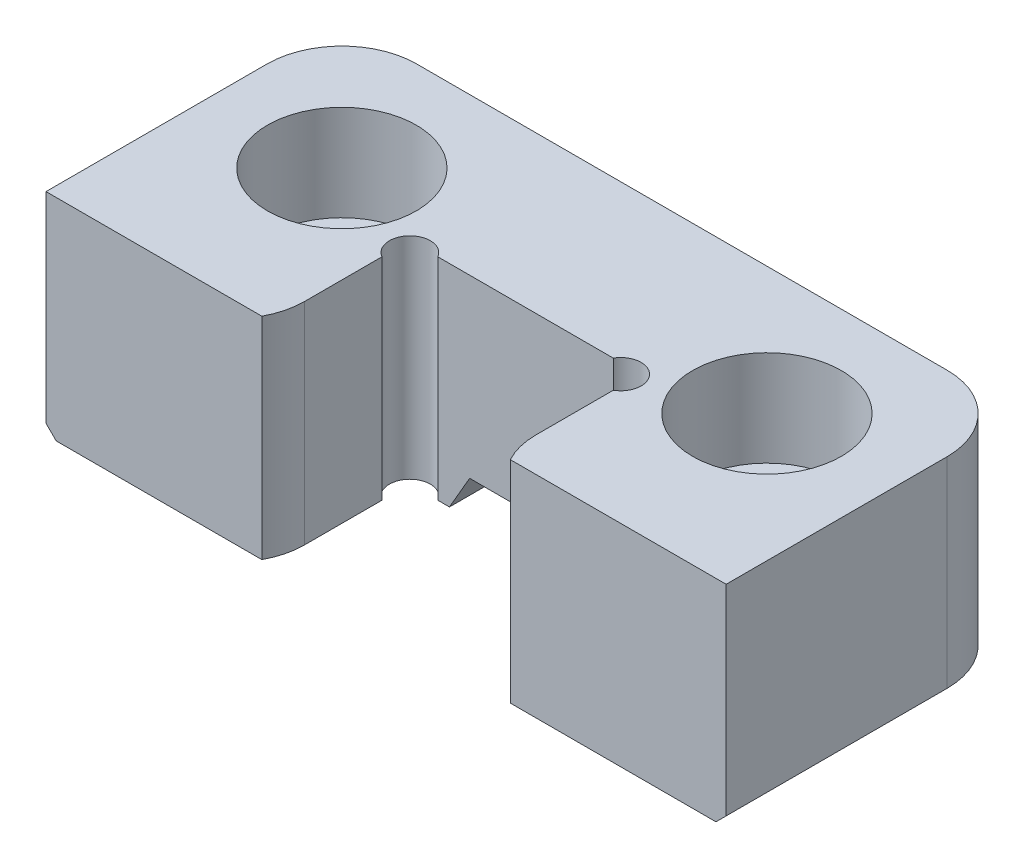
ISO-10303-21;
HEADER;
FILE_DESCRIPTION(('STEP AP214'),'2;1');
FILE_NAME('part.step','',(''),(''),'','','');
FILE_SCHEMA(('AUTOMOTIVE_DESIGN { 1 0 10303 214 1 1 1 1 }'));
ENDSEC;
DATA;
#1=APPLICATION_CONTEXT('core data for automotive mechanical design processes');
#2=APPLICATION_PROTOCOL_DEFINITION('international standard','automotive_design',2000,#1);
#3=PRODUCT_CONTEXT('',#1,'mechanical');
#4=PRODUCT('Part','Part','',(#3));
#5=PRODUCT_RELATED_PRODUCT_CATEGORY('part','',(#4));
#6=PRODUCT_DEFINITION_FORMATION('','',#4);
#7=PRODUCT_DEFINITION_CONTEXT('part definition',#1,'design');
#8=PRODUCT_DEFINITION('design','',#6,#7);
#9=PRODUCT_DEFINITION_SHAPE('','',#8);
#10=(LENGTH_UNIT() NAMED_UNIT(*) SI_UNIT(.MILLI.,.METRE.));
#11=(NAMED_UNIT(*) PLANE_ANGLE_UNIT() SI_UNIT($,.RADIAN.));
#12=(NAMED_UNIT(*) SI_UNIT($,.STERADIAN.) SOLID_ANGLE_UNIT());
#13=UNCERTAINTY_MEASURE_WITH_UNIT(LENGTH_MEASURE(1.E-05),#10,'distance_accuracy_value','');
#14=(GEOMETRIC_REPRESENTATION_CONTEXT(3) GLOBAL_UNCERTAINTY_ASSIGNED_CONTEXT((#13)) GLOBAL_UNIT_ASSIGNED_CONTEXT((#10,
#11,#12)) REPRESENTATION_CONTEXT('',''));
#15=CARTESIAN_POINT('',(0.,0.,0.));
#16=DIRECTION('',(0.,0.,1.));
#17=DIRECTION('',(1.,0.,0.));
#18=AXIS2_PLACEMENT_3D('',#15,#16,#17);
#19=CARTESIAN_POINT('',(-25.4,-15.748,-22.098));
#20=DIRECTION('',(0.,-1.,0.));
#21=DIRECTION('',(0.,0.,-1.));
#22=AXIS2_PLACEMENT_3D('',#19,#20,#21);
#23=PLANE('',#22);
#24=CARTESIAN_POINT('',(-15.875,-15.748,-12.573));
#25=DIRECTION('',(0.,1.,0.));
#26=DIRECTION('',(0.,0.,1.));
#27=AXIS2_PLACEMENT_3D('',#24,#25,#26);
#28=CIRCLE('',#27,3.2639);
#29=CARTESIAN_POINT('',(-15.875,-15.748,-9.3091));
#30=VERTEX_POINT('',#29);
#31=EDGE_CURVE('E498',#30,#30,#28,.T.);
#32=ORIENTED_EDGE('',*,*,#31,.T.);
#33=EDGE_LOOP('',(#32));
#34=FACE_BOUND('',#33,.T.);
#35=CARTESIAN_POINT('',(-19.812,-15.748,-16.51));
#36=DIRECTION('',(0.,-1.,0.));
#37=DIRECTION('',(0.,0.,-1.));
#38=AXIS2_PLACEMENT_3D('',#35,#36,#37);
#39=CIRCLE('',#38,4.82599999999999);
#40=CARTESIAN_POINT('',(-24.638,-15.748,-16.51));
#41=VERTEX_POINT('',#40);
#42=CARTESIAN_POINT('',(-19.812,-15.748,-21.336));
#43=VERTEX_POINT('',#42);
#44=EDGE_CURVE('E342',#41,#43,#39,.T.);
#45=ORIENTED_EDGE('',*,*,#44,.T.);
#46=DIRECTION('',(1.,0.,0.));
#47=VECTOR('',#46,1.);
#48=CARTESIAN_POINT('',(-25.4,-15.748,-21.336));
#49=LINE('',#48,#47);
#50=CARTESIAN_POINT('',(-5.67904355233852,-15.748,-21.336));
#51=VERTEX_POINT('',#50);
#52=EDGE_CURVE('E344',#43,#51,#49,.T.);
#53=ORIENTED_EDGE('',*,*,#52,.T.);
#54=DIRECTION('',(0.,0.,-1.));
#55=VECTOR('',#54,1.);
#56=CARTESIAN_POINT('',(-5.67904355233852,-15.748,-22.098));
#57=LINE('',#56,#55);
#58=CARTESIAN_POINT('',(-5.67904355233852,-15.748,-10.414));
#59=VERTEX_POINT('',#58);
#60=EDGE_CURVE('E319',#59,#51,#57,.T.);
#61=ORIENTED_EDGE('',*,*,#60,.F.);
#62=DIRECTION('',(1.,0.,0.));
#63=VECTOR('',#62,1.);
#64=CARTESIAN_POINT('',(-8.636,-15.748,-10.414));
#65=LINE('',#64,#63);
#66=CARTESIAN_POINT('',(-6.55417728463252,-15.748,-10.414));
#67=VERTEX_POINT('',#66);
#68=EDGE_CURVE('E269',#67,#59,#65,.T.);
#69=ORIENTED_EDGE('',*,*,#68,.F.);
#70=CARTESIAN_POINT('',(-7.874,-15.748,-9.652));
#71=DIRECTION('',(0.,1.,0.));
#72=DIRECTION('',(0.,0.,1.));
#73=AXIS2_PLACEMENT_3D('',#70,#71,#72);
#74=CIRCLE('',#73,1.524);
#75=CARTESIAN_POINT('',(-8.636,-15.748,-8.33217728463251));
#76=VERTEX_POINT('',#75);
#77=EDGE_CURVE('E232',#67,#76,#74,.T.);
#78=ORIENTED_EDGE('',*,*,#77,.T.);
#79=DIRECTION('',(0.,0.,-1.));
#80=VECTOR('',#79,1.);
#81=CARTESIAN_POINT('',(-8.636,-15.748,0.));
#82=LINE('',#81,#80);
#83=CARTESIAN_POINT('',(-8.636,-15.748,-2.54));
#84=VERTEX_POINT('',#83);
#85=EDGE_CURVE('E264',#84,#76,#82,.T.);
#86=ORIENTED_EDGE('',*,*,#85,.F.);
#87=CARTESIAN_POINT('',(-13.9528873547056,-15.748,-2.54));
#88=DIRECTION('',(0.,-1.,0.));
#89=DIRECTION('',(0.,0.,1.));
#90=AXIS2_PLACEMENT_3D('',#87,#88,#89);
#91=CIRCLE('',#90,5.31688735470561);
#92=CARTESIAN_POINT('',(-9.28194621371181,-15.748,0.));
#93=VERTEX_POINT('',#92);
#94=EDGE_CURVE('E241',#84,#93,#91,.T.);
#95=ORIENTED_EDGE('',*,*,#94,.T.);
#96=DIRECTION('',(1.,0.,0.));
#97=VECTOR('',#96,1.);
#98=CARTESIAN_POINT('',(-25.4,-15.748,0.));
#99=LINE('',#98,#97);
#100=CARTESIAN_POINT('',(-24.638,-15.748,0.));
#101=VERTEX_POINT('',#100);
#102=EDGE_CURVE('E262',#101,#93,#99,.T.);
#103=ORIENTED_EDGE('',*,*,#102,.F.);
#104=DIRECTION('',(0.,0.,-1.));
#105=VECTOR('',#104,1.);
#106=CARTESIAN_POINT('',(-24.638,-15.748,-22.098));
#107=LINE('',#106,#105);
#108=EDGE_CURVE('E340',#101,#41,#107,.T.);
#109=ORIENTED_EDGE('',*,*,#108,.T.);
#110=EDGE_LOOP('',(#45,#53,#61,#69,#78,#86,#95,#103,#109));
#111=FACE_BOUND('',#110,.T.);
#112=ADVANCED_FACE('F34',(#34,#111),#23,.T.);
#113=CARTESIAN_POINT('',(-25.4,-15.748,0.));
#114=DIRECTION('',(-1.,0.,0.));
#115=DIRECTION('',(0.,0.,1.));
#116=AXIS2_PLACEMENT_3D('',#113,#114,#115);
#117=PLANE('',#116);
#118=DIRECTION('',(0.,1.,0.));
#119=VECTOR('',#118,1.);
#120=CARTESIAN_POINT('',(-25.4,-15.748,-16.51));
#121=LINE('',#120,#119);
#122=CARTESIAN_POINT('',(-25.4,0.,-16.51));
#123=VERTEX_POINT('',#122);
#124=CARTESIAN_POINT('',(-25.4,-14.986,-16.51));
#125=VERTEX_POINT('',#124);
#126=EDGE_CURVE('E311',#123,#125,#121,.F.);
#127=ORIENTED_EDGE('',*,*,#126,.T.);
#128=DIRECTION('',(0.,0.,1.));
#129=VECTOR('',#128,1.);
#130=CARTESIAN_POINT('',(-25.4,-14.986,0.));
#131=LINE('',#130,#129);
#132=CARTESIAN_POINT('',(-25.4,-14.986,0.));
#133=VERTEX_POINT('',#132);
#134=EDGE_CURVE('E349',#125,#133,#131,.T.);
#135=ORIENTED_EDGE('',*,*,#134,.T.);
#136=DIRECTION('',(0.,1.,0.));
#137=VECTOR('',#136,1.);
#138=CARTESIAN_POINT('',(-25.4,-15.748,0.));
#139=LINE('',#138,#137);
#140=CARTESIAN_POINT('',(-25.4,0.,0.));
#141=VERTEX_POINT('',#140);
#142=EDGE_CURVE('E276',#133,#141,#139,.T.);
#143=ORIENTED_EDGE('',*,*,#142,.T.);
#144=DIRECTION('',(0.,0.,1.));
#145=VECTOR('',#144,1.);
#146=CARTESIAN_POINT('',(-25.4,0.,0.));
#147=LINE('',#146,#145);
#148=EDGE_CURVE('E254',#123,#141,#147,.T.);
#149=ORIENTED_EDGE('',*,*,#148,.F.);
#150=EDGE_LOOP('',(#127,#135,#143,#149));
#151=FACE_BOUND('',#150,.T.);
#152=ADVANCED_FACE('F424',(#151),#117,.T.);
#153=CARTESIAN_POINT('',(-25.4,-15.748,-22.098));
#154=DIRECTION('',(0.,0.,-1.));
#155=DIRECTION('',(-1.,0.,0.));
#156=AXIS2_PLACEMENT_3D('',#153,#154,#155);
#157=PLANE('',#156);
#158=DIRECTION('',(0.,1.,0.));
#159=VECTOR('',#158,1.);
#160=CARTESIAN_POINT('',(19.812,-15.748,-22.098));
#161=LINE('',#160,#159);
#162=CARTESIAN_POINT('',(19.812,0.,-22.098));
#163=VERTEX_POINT('',#162);
#164=CARTESIAN_POINT('',(19.812,-14.986,-22.098));
#165=VERTEX_POINT('',#164);
#166=EDGE_CURVE('E309',#163,#165,#161,.F.);
#167=ORIENTED_EDGE('',*,*,#166,.T.);
#168=DIRECTION('',(-1.,0.,0.));
#169=VECTOR('',#168,1.);
#170=CARTESIAN_POINT('',(-25.4,-14.986,-22.098));
#171=LINE('',#170,#169);
#172=CARTESIAN_POINT('',(5.23910264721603,-14.986,-22.098));
#173=VERTEX_POINT('',#172);
#174=EDGE_CURVE('E336',#165,#173,#171,.T.);
#175=ORIENTED_EDGE('',*,*,#174,.T.);
#176=DIRECTION('',(0.499999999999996,-0.866025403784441,0.));
#177=VECTOR('',#176,1.);
#178=CARTESIAN_POINT('',(4.7625,-14.1605,-22.098));
#179=LINE('',#178,#177);
#180=CARTESIAN_POINT('',(4.7625,-14.1605,-22.098));
#181=VERTEX_POINT('',#180);
#182=EDGE_CURVE('E200',#181,#173,#179,.T.);
#183=ORIENTED_EDGE('',*,*,#182,.F.);
#184=DIRECTION('',(1.,0.,0.));
#185=VECTOR('',#184,1.);
#186=CARTESIAN_POINT('',(4.7625,-14.1605,-22.098));
#187=LINE('',#186,#185);
#188=CARTESIAN_POINT('',(-4.7625,-14.1605,-22.098));
#189=VERTEX_POINT('',#188);
#190=EDGE_CURVE('E194',#189,#181,#187,.T.);
#191=ORIENTED_EDGE('',*,*,#190,.F.);
#192=DIRECTION('',(0.499999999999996,0.866025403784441,0.));
#193=VECTOR('',#192,1.);
#194=CARTESIAN_POINT('',(-4.7625,-14.1605,-22.098));
#195=LINE('',#194,#193);
#196=CARTESIAN_POINT('',(-5.23910264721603,-14.986,-22.098));
#197=VERTEX_POINT('',#196);
#198=EDGE_CURVE('E203',#197,#189,#195,.T.);
#199=ORIENTED_EDGE('',*,*,#198,.F.);
#200=DIRECTION('',(-1.,0.,0.));
#201=VECTOR('',#200,1.);
#202=CARTESIAN_POINT('',(-25.4,-14.986,-22.098));
#203=LINE('',#202,#201);
#204=CARTESIAN_POINT('',(-19.812,-14.986,-22.098));
#205=VERTEX_POINT('',#204);
#206=EDGE_CURVE('E334',#197,#205,#203,.T.);
#207=ORIENTED_EDGE('',*,*,#206,.T.);
#208=DIRECTION('',(0.,1.,0.));
#209=VECTOR('',#208,1.);
#210=CARTESIAN_POINT('',(-19.812,-15.748,-22.098));
#211=LINE('',#210,#209);
#212=CARTESIAN_POINT('',(-19.812,0.,-22.098));
#213=VERTEX_POINT('',#212);
#214=EDGE_CURVE('E307',#205,#213,#211,.T.);
#215=ORIENTED_EDGE('',*,*,#214,.T.);
#216=DIRECTION('',(-1.,0.,0.));
#217=VECTOR('',#216,1.);
#218=CARTESIAN_POINT('',(-25.4,0.,-22.098));
#219=LINE('',#218,#217);
#220=EDGE_CURVE('E265',#163,#213,#219,.T.);
#221=ORIENTED_EDGE('',*,*,#220,.F.);
#222=EDGE_LOOP('',(#167,#175,#183,#191,#199,#207,#215,#221));
#223=FACE_BOUND('',#222,.T.);
#224=ADVANCED_FACE('F214',(#223),#157,.T.);
#225=CARTESIAN_POINT('',(25.4,-15.748,0.));
#226=DIRECTION('',(1.,0.,0.));
#227=DIRECTION('',(0.,0.,-1.));
#228=AXIS2_PLACEMENT_3D('',#225,#226,#227);
#229=PLANE('',#228);
#230=DIRECTION('',(0.,1.,0.));
#231=VECTOR('',#230,1.);
#232=CARTESIAN_POINT('',(25.4,-15.748,0.));
#233=LINE('',#232,#231);
#234=CARTESIAN_POINT('',(25.4,-14.986,0.));
#235=VERTEX_POINT('',#234);
#236=CARTESIAN_POINT('',(25.4,0.,0.));
#237=VERTEX_POINT('',#236);
#238=EDGE_CURVE('E298',#235,#237,#233,.T.);
#239=ORIENTED_EDGE('',*,*,#238,.F.);
#240=DIRECTION('',(0.,0.,-1.));
#241=VECTOR('',#240,1.);
#242=CARTESIAN_POINT('',(25.4,-14.986,0.));
#243=LINE('',#242,#241);
#244=CARTESIAN_POINT('',(25.4,-14.986,-16.51));
#245=VERTEX_POINT('',#244);
#246=EDGE_CURVE('E321',#235,#245,#243,.T.);
#247=ORIENTED_EDGE('',*,*,#246,.T.);
#248=DIRECTION('',(0.,1.,0.));
#249=VECTOR('',#248,1.);
#250=CARTESIAN_POINT('',(25.4,-15.748,-16.51));
#251=LINE('',#250,#249);
#252=CARTESIAN_POINT('',(25.4,0.,-16.51));
#253=VERTEX_POINT('',#252);
#254=EDGE_CURVE('E300',#245,#253,#251,.T.);
#255=ORIENTED_EDGE('',*,*,#254,.T.);
#256=DIRECTION('',(0.,0.,-1.));
#257=VECTOR('',#256,1.);
#258=CARTESIAN_POINT('',(25.4,0.,0.));
#259=LINE('',#258,#257);
#260=EDGE_CURVE('E293',#237,#253,#259,.T.);
#261=ORIENTED_EDGE('',*,*,#260,.F.);
#262=EDGE_LOOP('',(#239,#247,#255,#261));
#263=FACE_BOUND('',#262,.T.);
#264=ADVANCED_FACE('F410',(#263),#229,.T.);
#265=CARTESIAN_POINT('',(8.636,-15.748,0.));
#266=DIRECTION('',(0.,0.,1.));
#267=DIRECTION('',(1.,0.,0.));
#268=AXIS2_PLACEMENT_3D('',#265,#266,#267);
#269=PLANE('',#268);
#270=DIRECTION('',(1.,0.,0.));
#271=VECTOR('',#270,1.);
#272=CARTESIAN_POINT('',(8.636,-15.748,0.));
#273=LINE('',#272,#271);
#274=CARTESIAN_POINT('',(9.28194621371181,-15.748,0.));
#275=VERTEX_POINT('',#274);
#276=CARTESIAN_POINT('',(24.638,-15.748,0.));
#277=VERTEX_POINT('',#276);
#278=EDGE_CURVE('E273',#275,#277,#273,.T.);
#279=ORIENTED_EDGE('',*,*,#278,.T.);
#280=DIRECTION('',(-0.707106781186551,-0.707106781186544,0.));
#281=VECTOR('',#280,1.);
#282=CARTESIAN_POINT('',(16.6369999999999,-23.749,0.));
#283=LINE('',#282,#281);
#284=EDGE_CURVE('E330',#277,#235,#283,.F.);
#285=ORIENTED_EDGE('',*,*,#284,.T.);
#286=ORIENTED_EDGE('',*,*,#238,.T.);
#287=DIRECTION('',(1.,0.,0.));
#288=VECTOR('',#287,1.);
#289=CARTESIAN_POINT('',(8.636,0.,0.));
#290=LINE('',#289,#288);
#291=CARTESIAN_POINT('',(9.28194621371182,0.,0.));
#292=VERTEX_POINT('',#291);
#293=EDGE_CURVE('E290',#292,#237,#290,.T.);
#294=ORIENTED_EDGE('',*,*,#293,.F.);
#295=DIRECTION('',(0.,1.,0.));
#296=VECTOR('',#295,1.);
#297=CARTESIAN_POINT('',(9.28194621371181,-15.748,0.));
#298=LINE('',#297,#296);
#299=EDGE_CURVE('E258',#275,#292,#298,.T.);
#300=ORIENTED_EDGE('',*,*,#299,.F.);
#301=EDGE_LOOP('',(#279,#285,#286,#294,#300));
#302=FACE_BOUND('',#301,.T.);
#303=ADVANCED_FACE('F393',(#302),#269,.T.);
#304=CARTESIAN_POINT('',(8.636,-15.748,0.));
#305=DIRECTION('',(-1.,0.,0.));
#306=DIRECTION('',(0.,0.,1.));
#307=AXIS2_PLACEMENT_3D('',#304,#305,#306);
#308=PLANE('',#307);
#309=DIRECTION('',(0.,1.,0.));
#310=VECTOR('',#309,1.);
#311=CARTESIAN_POINT('',(8.636,-15.748,-8.33217728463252));
#312=LINE('',#311,#310);
#313=CARTESIAN_POINT('',(8.636,-15.748,-8.33217728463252));
#314=VERTEX_POINT('',#313);
#315=CARTESIAN_POINT('',(8.636,0.,-8.33217728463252));
#316=VERTEX_POINT('',#315);
#317=EDGE_CURVE('E229',#314,#316,#312,.T.);
#318=ORIENTED_EDGE('',*,*,#317,.F.);
#319=DIRECTION('',(0.,0.,1.));
#320=VECTOR('',#319,1.);
#321=CARTESIAN_POINT('',(8.636,-15.748,0.));
#322=LINE('',#321,#320);
#323=CARTESIAN_POINT('',(8.636,-15.748,-2.54));
#324=VERTEX_POINT('',#323);
#325=EDGE_CURVE('E271',#314,#324,#322,.T.);
#326=ORIENTED_EDGE('',*,*,#325,.T.);
#327=DIRECTION('',(0.,1.,0.));
#328=VECTOR('',#327,1.);
#329=CARTESIAN_POINT('',(8.636,-15.748,-2.54));
#330=LINE('',#329,#328);
#331=CARTESIAN_POINT('',(8.636,0.,-2.54));
#332=VERTEX_POINT('',#331);
#333=EDGE_CURVE('E255',#324,#332,#330,.T.);
#334=ORIENTED_EDGE('',*,*,#333,.T.);
#335=DIRECTION('',(0.,0.,1.));
#336=VECTOR('',#335,1.);
#337=CARTESIAN_POINT('',(8.636,0.,0.));
#338=LINE('',#337,#336);
#339=EDGE_CURVE('E288',#316,#332,#338,.T.);
#340=ORIENTED_EDGE('',*,*,#339,.F.);
#341=EDGE_LOOP('',(#318,#326,#334,#340));
#342=FACE_BOUND('',#341,.T.);
#343=ADVANCED_FACE('F382',(#342),#308,.T.);
#344=CARTESIAN_POINT('',(-8.636,-15.748,-10.414));
#345=DIRECTION('',(0.,0.,1.));
#346=DIRECTION('',(1.,0.,0.));
#347=AXIS2_PLACEMENT_3D('',#344,#345,#346);
#348=PLANE('',#347);
#349=DIRECTION('',(-0.499999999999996,-0.866025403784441,0.));
#350=VECTOR('',#349,1.);
#351=CARTESIAN_POINT('',(-6.41828266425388,-17.0283997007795,-10.414));
#352=LINE('',#351,#350);
#353=CARTESIAN_POINT('',(-4.17309094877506,-13.1396135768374,-10.414));
#354=VERTEX_POINT('',#353);
#355=EDGE_CURVE('E49',#354,#59,#352,.T.);
#356=ORIENTED_EDGE('',*,*,#355,.F.);
#357=DIRECTION('',(1.,0.,0.));
#358=VECTOR('',#357,1.);
#359=CARTESIAN_POINT('',(4.7625,-13.1396135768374,-10.414));
#360=LINE('',#359,#358);
#361=CARTESIAN_POINT('',(4.17309094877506,-13.1396135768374,-10.414));
#362=VERTEX_POINT('',#361);
#363=EDGE_CURVE('E364',#354,#362,#360,.T.);
#364=ORIENTED_EDGE('',*,*,#363,.T.);
#365=DIRECTION('',(-0.499999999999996,0.866025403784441,0.));
#366=VECTOR('',#365,1.);
#367=CARTESIAN_POINT('',(2.10028266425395,-9.54940431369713,-10.414));
#368=LINE('',#367,#366);
#369=CARTESIAN_POINT('',(5.67904355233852,-15.748,-10.414));
#370=VERTEX_POINT('',#369);
#371=EDGE_CURVE('E56',#370,#362,#368,.T.);
#372=ORIENTED_EDGE('',*,*,#371,.F.);
#373=CARTESIAN_POINT('',(6.55417728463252,-15.748,-10.414));
#374=VERTEX_POINT('',#373);
#375=EDGE_CURVE('E268',#370,#374,#65,.T.);
#376=ORIENTED_EDGE('',*,*,#375,.T.);
#377=DIRECTION('',(0.,1.,0.));
#378=VECTOR('',#377,1.);
#379=CARTESIAN_POINT('',(6.55417728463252,-15.748,-10.414));
#380=LINE('',#379,#378);
#381=CARTESIAN_POINT('',(6.55417728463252,0.,-10.414));
#382=VERTEX_POINT('',#381);
#383=EDGE_CURVE('E226',#382,#374,#380,.F.);
#384=ORIENTED_EDGE('',*,*,#383,.F.);
#385=DIRECTION('',(1.,0.,0.));
#386=VECTOR('',#385,1.);
#387=CARTESIAN_POINT('',(-8.636,0.,-10.414));
#388=LINE('',#387,#386);
#389=CARTESIAN_POINT('',(-6.55417728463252,0.,-10.414));
#390=VERTEX_POINT('',#389);
#391=EDGE_CURVE('E285',#390,#382,#388,.T.);
#392=ORIENTED_EDGE('',*,*,#391,.F.);
#393=DIRECTION('',(0.,1.,0.));
#394=VECTOR('',#393,1.);
#395=CARTESIAN_POINT('',(-6.55417728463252,-15.748,-10.414));
#396=LINE('',#395,#394);
#397=EDGE_CURVE('E238',#67,#390,#396,.T.);
#398=ORIENTED_EDGE('',*,*,#397,.F.);
#399=ORIENTED_EDGE('',*,*,#68,.T.);
#400=EDGE_LOOP('',(#356,#364,#372,#376,#384,#392,#398,#399));
#401=FACE_BOUND('',#400,.T.);
#402=ADVANCED_FACE('F369',(#401),#348,.T.);
#403=CARTESIAN_POINT('',(-8.636,-15.748,0.));
#404=DIRECTION('',(1.,0.,0.));
#405=DIRECTION('',(0.,0.,-1.));
#406=AXIS2_PLACEMENT_3D('',#403,#404,#405);
#407=PLANE('',#406);
#408=DIRECTION('',(0.,1.,0.));
#409=VECTOR('',#408,1.);
#410=CARTESIAN_POINT('',(-8.636,-15.748,-8.33217728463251));
#411=LINE('',#410,#409);
#412=CARTESIAN_POINT('',(-8.636,0.,-8.33217728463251));
#413=VERTEX_POINT('',#412);
#414=EDGE_CURVE('E235',#413,#76,#411,.F.);
#415=ORIENTED_EDGE('',*,*,#414,.F.);
#416=DIRECTION('',(0.,0.,-1.));
#417=VECTOR('',#416,1.);
#418=CARTESIAN_POINT('',(-8.636,0.,0.));
#419=LINE('',#418,#417);
#420=CARTESIAN_POINT('',(-8.636,0.,-2.54));
#421=VERTEX_POINT('',#420);
#422=EDGE_CURVE('E282',#421,#413,#419,.T.);
#423=ORIENTED_EDGE('',*,*,#422,.F.);
#424=DIRECTION('',(0.,1.,0.));
#425=VECTOR('',#424,1.);
#426=CARTESIAN_POINT('',(-8.636,-15.748,-2.54));
#427=LINE('',#426,#425);
#428=EDGE_CURVE('E252',#84,#421,#427,.T.);
#429=ORIENTED_EDGE('',*,*,#428,.F.);
#430=ORIENTED_EDGE('',*,*,#85,.T.);
#431=EDGE_LOOP('',(#415,#423,#429,#430));
#432=FACE_BOUND('',#431,.T.);
#433=ADVANCED_FACE('F448',(#432),#407,.T.);
#434=CARTESIAN_POINT('',(-25.4,-15.748,0.));
#435=DIRECTION('',(0.,0.,1.));
#436=DIRECTION('',(1.,0.,0.));
#437=AXIS2_PLACEMENT_3D('',#434,#435,#436);
#438=PLANE('',#437);
#439=ORIENTED_EDGE('',*,*,#142,.F.);
#440=DIRECTION('',(-0.707106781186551,0.707106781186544,0.));
#441=VECTOR('',#440,1.);
#442=CARTESIAN_POINT('',(-25.019,-15.367,0.));
#443=LINE('',#442,#441);
#444=EDGE_CURVE('E351',#133,#101,#443,.F.);
#445=ORIENTED_EDGE('',*,*,#444,.T.);
#446=ORIENTED_EDGE('',*,*,#102,.T.);
#447=DIRECTION('',(0.,1.,0.));
#448=VECTOR('',#447,1.);
#449=CARTESIAN_POINT('',(-9.28194621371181,-15.748,0.));
#450=LINE('',#449,#448);
#451=CARTESIAN_POINT('',(-9.28194621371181,0.,0.));
#452=VERTEX_POINT('',#451);
#453=EDGE_CURVE('E248',#93,#452,#450,.T.);
#454=ORIENTED_EDGE('',*,*,#453,.T.);
#455=DIRECTION('',(1.,0.,0.));
#456=VECTOR('',#455,1.);
#457=CARTESIAN_POINT('',(-25.4,0.,0.));
#458=LINE('',#457,#456);
#459=EDGE_CURVE('E279',#141,#452,#458,.T.);
#460=ORIENTED_EDGE('',*,*,#459,.F.);
#461=EDGE_LOOP('',(#439,#445,#446,#454,#460));
#462=FACE_BOUND('',#461,.T.);
#463=ADVANCED_FACE('F429',(#462),#438,.T.);
#464=CARTESIAN_POINT('',(15.875,-15.748,-12.573));
#465=DIRECTION('',(0.,1.,0.));
#466=DIRECTION('',(0.,0.,1.));
#467=AXIS2_PLACEMENT_3D('',#464,#465,#466);
#468=CIRCLE('',#467,3.2639);
#469=CARTESIAN_POINT('',(15.875,-15.748,-9.3091));
#470=VERTEX_POINT('',#469);
#471=EDGE_CURVE('E360',#470,#470,#468,.T.);
#472=ORIENTED_EDGE('',*,*,#471,.T.);
#473=EDGE_LOOP('',(#472));
#474=FACE_BOUND('',#473,.T.);
#475=CARTESIAN_POINT('',(19.812,-15.748,-16.51));
#476=DIRECTION('',(0.,-1.,0.));
#477=DIRECTION('',(0.,0.,-1.));
#478=AXIS2_PLACEMENT_3D('',#475,#476,#477);
#479=CIRCLE('',#478,4.82599999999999);
#480=CARTESIAN_POINT('',(19.812,-15.748,-21.336));
#481=VERTEX_POINT('',#480);
#482=CARTESIAN_POINT('',(24.638,-15.748,-16.51));
#483=VERTEX_POINT('',#482);
#484=EDGE_CURVE('E326',#481,#483,#479,.T.);
#485=ORIENTED_EDGE('',*,*,#484,.T.);
#486=DIRECTION('',(0.,0.,1.));
#487=VECTOR('',#486,1.);
#488=CARTESIAN_POINT('',(24.638,-15.748,-22.098));
#489=LINE('',#488,#487);
#490=EDGE_CURVE('E328',#483,#277,#489,.T.);
#491=ORIENTED_EDGE('',*,*,#490,.T.);
#492=ORIENTED_EDGE('',*,*,#278,.F.);
#493=CARTESIAN_POINT('',(13.9528873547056,-15.748,-2.54));
#494=DIRECTION('',(0.,-1.,0.));
#495=DIRECTION('',(0.,0.,-1.));
#496=AXIS2_PLACEMENT_3D('',#493,#494,#495);
#497=CIRCLE('',#496,5.31688735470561);
#498=EDGE_CURVE('E244',#275,#324,#497,.T.);
#499=ORIENTED_EDGE('',*,*,#498,.T.);
#500=ORIENTED_EDGE('',*,*,#325,.F.);
#501=CARTESIAN_POINT('',(7.874,-15.748,-9.652));
#502=DIRECTION('',(0.,1.,0.));
#503=DIRECTION('',(0.,0.,-1.));
#504=AXIS2_PLACEMENT_3D('',#501,#502,#503);
#505=CIRCLE('',#504,1.524);
#506=EDGE_CURVE('E223',#314,#374,#505,.T.);
#507=ORIENTED_EDGE('',*,*,#506,.T.);
#508=ORIENTED_EDGE('',*,*,#375,.F.);
#509=DIRECTION('',(0.,0.,1.));
#510=VECTOR('',#509,1.);
#511=CARTESIAN_POINT('',(5.67904355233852,-15.748,-22.098));
#512=LINE('',#511,#510);
#513=CARTESIAN_POINT('',(5.67904355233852,-15.748,-21.336));
#514=VERTEX_POINT('',#513);
#515=EDGE_CURVE('E317',#514,#370,#512,.T.);
#516=ORIENTED_EDGE('',*,*,#515,.F.);
#517=DIRECTION('',(1.,0.,0.));
#518=VECTOR('',#517,1.);
#519=CARTESIAN_POINT('',(-25.4,-15.748,-21.336));
#520=LINE('',#519,#518);
#521=EDGE_CURVE('E324',#514,#481,#520,.T.);
#522=ORIENTED_EDGE('',*,*,#521,.T.);
#523=EDGE_LOOP('',(#485,#491,#492,#499,#500,#507,#508,#516,#522));
#524=FACE_BOUND('',#523,.T.);
#525=ADVANCED_FACE('F374',(#474,#524),#23,.T.);
#526=CARTESIAN_POINT('',(-25.4,0.,-22.098));
#527=DIRECTION('',(0.,-1.,0.));
#528=DIRECTION('',(0.,0.,-1.));
#529=AXIS2_PLACEMENT_3D('',#526,#527,#528);
#530=PLANE('',#529);
#531=CARTESIAN_POINT('',(-15.875,0.,-12.573));
#532=DIRECTION('',(0.,1.,0.));
#533=DIRECTION('',(0.,0.,1.));
#534=AXIS2_PLACEMENT_3D('',#531,#532,#533);
#535=CIRCLE('',#534,5.55625);
#536=CARTESIAN_POINT('',(-15.875,0.,-7.01675));
#537=VERTEX_POINT('',#536);
#538=EDGE_CURVE('E506',#537,#537,#535,.T.);
#539=ORIENTED_EDGE('',*,*,#538,.F.);
#540=EDGE_LOOP('',(#539));
#541=FACE_BOUND('',#540,.T.);
#542=CARTESIAN_POINT('',(15.875,0.,-12.573));
#543=DIRECTION('',(0.,1.,0.));
#544=DIRECTION('',(0.,0.,1.));
#545=AXIS2_PLACEMENT_3D('',#542,#543,#544);
#546=CIRCLE('',#545,5.55625);
#547=CARTESIAN_POINT('',(15.875,0.,-7.01675));
#548=VERTEX_POINT('',#547);
#549=EDGE_CURVE('E495',#548,#548,#546,.T.);
#550=ORIENTED_EDGE('',*,*,#549,.F.);
#551=EDGE_LOOP('',(#550));
#552=FACE_BOUND('',#551,.T.);
#553=ORIENTED_EDGE('',*,*,#391,.T.);
#554=CARTESIAN_POINT('',(7.874,0.,-9.652));
#555=DIRECTION('',(0.,-1.,0.));
#556=DIRECTION('',(0.,0.,-1.));
#557=AXIS2_PLACEMENT_3D('',#554,#555,#556);
#558=CIRCLE('',#557,1.524);
#559=EDGE_CURVE('E314',#382,#316,#558,.T.);
#560=ORIENTED_EDGE('',*,*,#559,.T.);
#561=ORIENTED_EDGE('',*,*,#339,.T.);
#562=CARTESIAN_POINT('',(13.9528873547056,0.,-2.54));
#563=DIRECTION('',(0.,-1.,0.));
#564=DIRECTION('',(0.,0.,-1.));
#565=AXIS2_PLACEMENT_3D('',#562,#563,#564);
#566=CIRCLE('',#565,5.31688735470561);
#567=EDGE_CURVE('E245',#292,#332,#566,.T.);
#568=ORIENTED_EDGE('',*,*,#567,.F.);
#569=ORIENTED_EDGE('',*,*,#293,.T.);
#570=ORIENTED_EDGE('',*,*,#260,.T.);
#571=CARTESIAN_POINT('',(19.812,0.,-16.51));
#572=DIRECTION('',(0.,-1.,0.));
#573=DIRECTION('',(0.,0.,-1.));
#574=AXIS2_PLACEMENT_3D('',#571,#572,#573);
#575=CIRCLE('',#574,5.588);
#576=EDGE_CURVE('E305',#253,#163,#575,.F.);
#577=ORIENTED_EDGE('',*,*,#576,.T.);
#578=ORIENTED_EDGE('',*,*,#220,.T.);
#579=CARTESIAN_POINT('',(-19.812,0.,-16.51));
#580=DIRECTION('',(0.,-1.,0.));
#581=DIRECTION('',(0.,0.,-1.));
#582=AXIS2_PLACEMENT_3D('',#579,#580,#581);
#583=CIRCLE('',#582,5.588);
#584=EDGE_CURVE('E303',#213,#123,#583,.F.);
#585=ORIENTED_EDGE('',*,*,#584,.T.);
#586=ORIENTED_EDGE('',*,*,#148,.T.);
#587=ORIENTED_EDGE('',*,*,#459,.T.);
#588=CARTESIAN_POINT('',(-13.9528873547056,0.,-2.54));
#589=DIRECTION('',(0.,-1.,0.));
#590=DIRECTION('',(0.,0.,1.));
#591=AXIS2_PLACEMENT_3D('',#588,#589,#590);
#592=CIRCLE('',#591,5.31688735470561);
#593=EDGE_CURVE('E240',#421,#452,#592,.T.);
#594=ORIENTED_EDGE('',*,*,#593,.F.);
#595=ORIENTED_EDGE('',*,*,#422,.T.);
#596=CARTESIAN_POINT('',(-7.874,0.,-9.652));
#597=DIRECTION('',(0.,1.,0.));
#598=DIRECTION('',(0.,0.,1.));
#599=AXIS2_PLACEMENT_3D('',#596,#597,#598);
#600=CIRCLE('',#599,1.524);
#601=EDGE_CURVE('E231',#390,#413,#600,.T.);
#602=ORIENTED_EDGE('',*,*,#601,.F.);
#603=EDGE_LOOP('',(#553,#560,#561,#568,#569,#570,#577,#578,#585,#586,#587,#594,#595,#602));
#604=FACE_BOUND('',#603,.T.);
#605=ADVANCED_FACE('F386',(#541,#552,#604),#530,.F.);
#606=CARTESIAN_POINT('',(19.812,-15.748,-16.51));
#607=DIRECTION('',(0.,1.,0.));
#608=DIRECTION('',(0.,0.,1.));
#609=AXIS2_PLACEMENT_3D('',#606,#607,#608);
#610=CYLINDRICAL_SURFACE('',#609,5.588);
#611=ORIENTED_EDGE('',*,*,#254,.F.);
#612=CARTESIAN_POINT('',(19.812,-14.986,-16.51));
#613=DIRECTION('',(0.,-1.,0.));
#614=DIRECTION('',(0.,0.,-1.));
#615=AXIS2_PLACEMENT_3D('',#612,#613,#614);
#616=CIRCLE('',#615,5.588);
#617=EDGE_CURVE('E332',#245,#165,#616,.F.);
#618=ORIENTED_EDGE('',*,*,#617,.T.);
#619=ORIENTED_EDGE('',*,*,#166,.F.);
#620=ORIENTED_EDGE('',*,*,#576,.F.);
#621=EDGE_LOOP('',(#611,#618,#619,#620));
#622=FACE_BOUND('',#621,.T.);
#623=ADVANCED_FACE('F413',(#622),#610,.T.);
#624=CARTESIAN_POINT('',(-19.812,-15.748,-16.51));
#625=DIRECTION('',(0.,1.,0.));
#626=DIRECTION('',(0.,0.,1.));
#627=AXIS2_PLACEMENT_3D('',#624,#625,#626);
#628=CYLINDRICAL_SURFACE('',#627,5.588);
#629=ORIENTED_EDGE('',*,*,#214,.F.);
#630=CARTESIAN_POINT('',(-19.812,-14.986,-16.51));
#631=DIRECTION('',(0.,-1.,0.));
#632=DIRECTION('',(0.,0.,-1.));
#633=AXIS2_PLACEMENT_3D('',#630,#631,#632);
#634=CIRCLE('',#633,5.588);
#635=EDGE_CURVE('E347',#205,#125,#634,.F.);
#636=ORIENTED_EDGE('',*,*,#635,.T.);
#637=ORIENTED_EDGE('',*,*,#126,.F.);
#638=ORIENTED_EDGE('',*,*,#584,.F.);
#639=EDGE_LOOP('',(#629,#636,#637,#638));
#640=FACE_BOUND('',#639,.T.);
#641=ADVANCED_FACE('F420',(#640),#628,.T.);
#642=CARTESIAN_POINT('',(13.9528873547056,-15.748,-2.54));
#643=DIRECTION('',(0.,1.,0.));
#644=DIRECTION('',(0.,0.,1.));
#645=AXIS2_PLACEMENT_3D('',#642,#643,#644);
#646=CYLINDRICAL_SURFACE('',#645,5.31688735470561);
#647=ORIENTED_EDGE('',*,*,#567,.T.);
#648=ORIENTED_EDGE('',*,*,#333,.F.);
#649=ORIENTED_EDGE('',*,*,#498,.F.);
#650=ORIENTED_EDGE('',*,*,#299,.T.);
#651=EDGE_LOOP('',(#647,#648,#649,#650));
#652=FACE_BOUND('',#651,.T.);
#653=ADVANCED_FACE('F389',(#652),#646,.T.);
#654=CARTESIAN_POINT('',(-13.9528873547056,-15.748,-2.54));
#655=DIRECTION('',(0.,1.,0.));
#656=DIRECTION('',(0.,0.,1.));
#657=AXIS2_PLACEMENT_3D('',#654,#655,#656);
#658=CYLINDRICAL_SURFACE('',#657,5.31688735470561);
#659=ORIENTED_EDGE('',*,*,#593,.T.);
#660=ORIENTED_EDGE('',*,*,#453,.F.);
#661=ORIENTED_EDGE('',*,*,#94,.F.);
#662=ORIENTED_EDGE('',*,*,#428,.T.);
#663=EDGE_LOOP('',(#659,#660,#661,#662));
#664=FACE_BOUND('',#663,.T.);
#665=ADVANCED_FACE('F441',(#664),#658,.T.);
#666=CARTESIAN_POINT('',(-7.874,-15.748,-9.652));
#667=DIRECTION('',(0.,1.,0.));
#668=DIRECTION('',(0.,0.,1.));
#669=AXIS2_PLACEMENT_3D('',#666,#667,#668);
#670=CYLINDRICAL_SURFACE('',#669,1.524);
#671=ORIENTED_EDGE('',*,*,#397,.T.);
#672=ORIENTED_EDGE('',*,*,#601,.T.);
#673=ORIENTED_EDGE('',*,*,#414,.T.);
#674=ORIENTED_EDGE('',*,*,#77,.F.);
#675=EDGE_LOOP('',(#671,#672,#673,#674));
#676=FACE_BOUND('',#675,.T.);
#677=ADVANCED_FACE('F450',(#676),#670,.F.);
#678=CARTESIAN_POINT('',(7.874,-15.748,-9.652));
#679=DIRECTION('',(0.,1.,0.));
#680=DIRECTION('',(0.,0.,1.));
#681=AXIS2_PLACEMENT_3D('',#678,#679,#680);
#682=CYLINDRICAL_SURFACE('',#681,1.524);
#683=ORIENTED_EDGE('',*,*,#317,.T.);
#684=ORIENTED_EDGE('',*,*,#559,.F.);
#685=ORIENTED_EDGE('',*,*,#383,.T.);
#686=ORIENTED_EDGE('',*,*,#506,.F.);
#687=EDGE_LOOP('',(#683,#684,#685,#686));
#688=FACE_BOUND('',#687,.T.);
#689=ADVANCED_FACE('F379',(#688),#682,.F.);
#690=CARTESIAN_POINT('',(-4.7625,-14.1605,0.));
#691=DIRECTION('',(-0.866025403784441,0.499999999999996,0.));
#692=DIRECTION('',(-0.499999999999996,-0.866025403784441,0.));
#693=AXIS2_PLACEMENT_3D('',#690,#691,#692);
#694=PLANE('',#693);
#695=ORIENTED_EDGE('',*,*,#60,.T.);
#696=DIRECTION('',(-0.377964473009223,-0.654653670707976,0.654653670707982));
#697=VECTOR('',#696,1.);
#698=CARTESIAN_POINT('',(-8.11923084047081,-19.9745283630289,-17.1094716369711));
#699=LINE('',#698,#697);
#700=EDGE_CURVE('E207',#51,#197,#699,.F.);
#701=ORIENTED_EDGE('',*,*,#700,.T.);
#702=ORIENTED_EDGE('',*,*,#198,.T.);
#703=DIRECTION('',(0.,0.,-1.));
#704=VECTOR('',#703,1.);
#705=CARTESIAN_POINT('',(-4.7625,-14.1605,0.));
#706=LINE('',#705,#704);
#707=CARTESIAN_POINT('',(-4.7625,-14.1605,-14.224));
#708=VERTEX_POINT('',#707);
#709=EDGE_CURVE('E189',#708,#189,#706,.T.);
#710=ORIENTED_EDGE('',*,*,#709,.F.);
#711=DIRECTION('',(0.147788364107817,0.255976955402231,0.955319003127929));
#712=VECTOR('',#711,1.);
#713=CARTESIAN_POINT('',(-2.75428409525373,-10.6821680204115,-1.24268832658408));
#714=LINE('',#713,#712);
#715=EDGE_CURVE('E42',#708,#354,#714,.T.);
#716=ORIENTED_EDGE('',*,*,#715,.T.);
#717=ORIENTED_EDGE('',*,*,#355,.T.);
#718=EDGE_LOOP('',(#695,#701,#702,#710,#716,#717));
#719=FACE_BOUND('',#718,.T.);
#720=ADVANCED_FACE('F205',(#719),#694,.F.);
#721=CARTESIAN_POINT('',(4.7625,-14.1605,0.));
#722=DIRECTION('',(0.866025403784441,0.499999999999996,0.));
#723=DIRECTION('',(-0.499999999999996,0.866025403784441,0.));
#724=AXIS2_PLACEMENT_3D('',#721,#722,#723);
#725=PLANE('',#724);
#726=ORIENTED_EDGE('',*,*,#182,.T.);
#727=DIRECTION('',(-0.377964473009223,0.654653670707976,-0.654653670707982));
#728=VECTOR('',#727,1.);
#729=CARTESIAN_POINT('',(0.862087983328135,-7.40478821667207,-29.679211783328));
#730=LINE('',#729,#728);
#731=EDGE_CURVE('E338',#173,#514,#730,.F.);
#732=ORIENTED_EDGE('',*,*,#731,.T.);
#733=ORIENTED_EDGE('',*,*,#515,.T.);
#734=ORIENTED_EDGE('',*,*,#371,.T.);
#735=DIRECTION('',(0.147788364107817,-0.255976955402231,-0.955319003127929));
#736=VECTOR('',#735,1.);
#737=CARTESIAN_POINT('',(2.75428409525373,-10.6821680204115,-1.24268832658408));
#738=LINE('',#737,#736);
#739=CARTESIAN_POINT('',(4.7625,-14.1605,-14.224));
#740=VERTEX_POINT('',#739);
#741=EDGE_CURVE('E11',#362,#740,#738,.T.);
#742=ORIENTED_EDGE('',*,*,#741,.T.);
#743=DIRECTION('',(0.,0.,-1.));
#744=VECTOR('',#743,1.);
#745=CARTESIAN_POINT('',(4.7625,-14.1605,0.));
#746=LINE('',#745,#744);
#747=EDGE_CURVE('E199',#740,#181,#746,.T.);
#748=ORIENTED_EDGE('',*,*,#747,.T.);
#749=EDGE_LOOP('',(#726,#732,#733,#734,#742,#748));
#750=FACE_BOUND('',#749,.T.);
#751=ADVANCED_FACE('F535',(#750),#725,.F.);
#752=CARTESIAN_POINT('',(4.7625,-14.1605,0.));
#753=DIRECTION('',(0.,1.,0.));
#754=DIRECTION('',(0.,0.,1.));
#755=AXIS2_PLACEMENT_3D('',#752,#753,#754);
#756=PLANE('',#755);
#757=ORIENTED_EDGE('',*,*,#747,.F.);
#758=DIRECTION('',(-1.,0.,0.));
#759=VECTOR('',#758,1.);
#760=CARTESIAN_POINT('',(-4.7625,-14.1605,-14.224));
#761=LINE('',#760,#759);
#762=EDGE_CURVE('E197',#740,#708,#761,.T.);
#763=ORIENTED_EDGE('',*,*,#762,.T.);
#764=ORIENTED_EDGE('',*,*,#709,.T.);
#765=ORIENTED_EDGE('',*,*,#190,.T.);
#766=EDGE_LOOP('',(#757,#763,#764,#765));
#767=FACE_BOUND('',#766,.T.);
#768=ADVANCED_FACE('F192',(#767),#756,.F.);
#769=CARTESIAN_POINT('',(-25.4,-14.986,-22.098));
#770=DIRECTION('',(0.,0.707106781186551,0.707106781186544));
#771=DIRECTION('',(0.,-0.707106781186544,0.707106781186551));
#772=AXIS2_PLACEMENT_3D('',#769,#770,#771);
#773=PLANE('',#772);
#774=ORIENTED_EDGE('',*,*,#731,.F.);
#775=ORIENTED_EDGE('',*,*,#174,.F.);
#776=DIRECTION('',(0.,0.707106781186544,-0.707106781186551));
#777=VECTOR('',#776,1.);
#778=CARTESIAN_POINT('',(19.812,-15.748,-21.336));
#779=LINE('',#778,#777);
#780=EDGE_CURVE('E211',#481,#165,#779,.T.);
#781=ORIENTED_EDGE('',*,*,#780,.F.);
#782=ORIENTED_EDGE('',*,*,#521,.F.);
#783=EDGE_LOOP('',(#774,#775,#781,#782));
#784=FACE_BOUND('',#783,.T.);
#785=ADVANCED_FACE('F540',(#784),#773,.F.);
#786=CARTESIAN_POINT('',(19.812,-15.748,-16.51));
#787=DIRECTION('',(0.,1.,0.));
#788=DIRECTION('',(0.,0.,1.));
#789=AXIS2_PLACEMENT_3D('',#786,#787,#788);
#790=CONICAL_SURFACE('',#789,4.82599999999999,0.785398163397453);
#791=ORIENTED_EDGE('',*,*,#780,.T.);
#792=ORIENTED_EDGE('',*,*,#617,.F.);
#793=DIRECTION('',(0.707106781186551,0.707106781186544,0.));
#794=VECTOR('',#793,1.);
#795=CARTESIAN_POINT('',(24.638,-15.748,-16.51));
#796=LINE('',#795,#794);
#797=EDGE_CURVE('E353',#483,#245,#796,.T.);
#798=ORIENTED_EDGE('',*,*,#797,.F.);
#799=ORIENTED_EDGE('',*,*,#484,.F.);
#800=EDGE_LOOP('',(#791,#792,#798,#799));
#801=FACE_BOUND('',#800,.T.);
#802=ADVANCED_FACE('F403',(#801),#790,.T.);
#803=CARTESIAN_POINT('',(25.4,-14.986,0.));
#804=DIRECTION('',(-0.707106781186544,0.707106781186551,0.));
#805=DIRECTION('',(-0.707106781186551,-0.707106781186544,0.));
#806=AXIS2_PLACEMENT_3D('',#803,#804,#805);
#807=PLANE('',#806);
#808=ORIENTED_EDGE('',*,*,#284,.F.);
#809=ORIENTED_EDGE('',*,*,#490,.F.);
#810=ORIENTED_EDGE('',*,*,#797,.T.);
#811=ORIENTED_EDGE('',*,*,#246,.F.);
#812=EDGE_LOOP('',(#808,#809,#810,#811));
#813=FACE_BOUND('',#812,.T.);
#814=ADVANCED_FACE('F399',(#813),#807,.F.);
#815=CARTESIAN_POINT('',(-25.4,-14.986,0.));
#816=DIRECTION('',(0.707106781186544,0.707106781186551,0.));
#817=DIRECTION('',(-0.707106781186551,0.707106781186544,0.));
#818=AXIS2_PLACEMENT_3D('',#815,#816,#817);
#819=PLANE('',#818);
#820=ORIENTED_EDGE('',*,*,#444,.F.);
#821=ORIENTED_EDGE('',*,*,#134,.F.);
#822=DIRECTION('',(-0.707106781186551,0.707106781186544,0.));
#823=VECTOR('',#822,1.);
#824=CARTESIAN_POINT('',(-24.638,-15.748,-16.51));
#825=LINE('',#824,#823);
#826=EDGE_CURVE('E355',#41,#125,#825,.T.);
#827=ORIENTED_EDGE('',*,*,#826,.F.);
#828=ORIENTED_EDGE('',*,*,#108,.F.);
#829=EDGE_LOOP('',(#820,#821,#827,#828));
#830=FACE_BOUND('',#829,.T.);
#831=ADVANCED_FACE('F433',(#830),#819,.F.);
#832=CARTESIAN_POINT('',(-19.812,-15.748,-16.51));
#833=DIRECTION('',(0.,1.,0.));
#834=DIRECTION('',(0.,0.,1.));
#835=AXIS2_PLACEMENT_3D('',#832,#833,#834);
#836=CONICAL_SURFACE('',#835,4.82599999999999,0.785398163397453);
#837=ORIENTED_EDGE('',*,*,#826,.T.);
#838=ORIENTED_EDGE('',*,*,#635,.F.);
#839=DIRECTION('',(0.,0.707106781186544,-0.707106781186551));
#840=VECTOR('',#839,1.);
#841=CARTESIAN_POINT('',(-19.812,-15.748,-21.336));
#842=LINE('',#841,#840);
#843=EDGE_CURVE('E358',#43,#205,#842,.T.);
#844=ORIENTED_EDGE('',*,*,#843,.F.);
#845=ORIENTED_EDGE('',*,*,#44,.F.);
#846=EDGE_LOOP('',(#837,#838,#844,#845));
#847=FACE_BOUND('',#846,.T.);
#848=ADVANCED_FACE('F459',(#847),#836,.T.);
#849=CARTESIAN_POINT('',(-25.4,-14.986,-22.098));
#850=DIRECTION('',(0.,0.707106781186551,0.707106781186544));
#851=DIRECTION('',(0.,-0.707106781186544,0.707106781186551));
#852=AXIS2_PLACEMENT_3D('',#849,#850,#851);
#853=PLANE('',#852);
#854=ORIENTED_EDGE('',*,*,#700,.F.);
#855=ORIENTED_EDGE('',*,*,#52,.F.);
#856=ORIENTED_EDGE('',*,*,#843,.T.);
#857=ORIENTED_EDGE('',*,*,#206,.F.);
#858=EDGE_LOOP('',(#854,#855,#856,#857));
#859=FACE_BOUND('',#858,.T.);
#860=ADVANCED_FACE('F455',(#859),#853,.F.);
#861=CARTESIAN_POINT('',(4.7625,-14.1605,-14.224));
#862=DIRECTION('',(0.,-0.965925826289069,0.258819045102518));
#863=DIRECTION('',(0.,-0.258819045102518,-0.965925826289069));
#864=AXIS2_PLACEMENT_3D('',#861,#862,#863);
#865=PLANE('',#864);
#866=ORIENTED_EDGE('',*,*,#741,.F.);
#867=ORIENTED_EDGE('',*,*,#363,.F.);
#868=ORIENTED_EDGE('',*,*,#715,.F.);
#869=ORIENTED_EDGE('',*,*,#762,.F.);
#870=EDGE_LOOP('',(#866,#867,#868,#869));
#871=FACE_BOUND('',#870,.T.);
#872=ADVANCED_FACE('F36',(#871),#865,.T.);
#873=CARTESIAN_POINT('',(15.875,0.,-12.573));
#874=DIRECTION('',(0.,1.,0.));
#875=DIRECTION('',(0.,0.,1.));
#876=AXIS2_PLACEMENT_3D('',#873,#874,#875);
#877=CYLINDRICAL_SURFACE('',#876,3.2639);
#878=ORIENTED_EDGE('',*,*,#471,.F.);
#879=EDGE_LOOP('',(#878));
#880=FACE_BOUND('',#879,.T.);
#881=CARTESIAN_POINT('',(15.875,-7.14375,-12.573));
#882=DIRECTION('',(0.,1.,0.));
#883=DIRECTION('',(0.,0.,1.));
#884=AXIS2_PLACEMENT_3D('',#881,#882,#883);
#885=CIRCLE('',#884,3.2639);
#886=CARTESIAN_POINT('',(15.875,-7.14375,-9.3091));
#887=VERTEX_POINT('',#886);
#888=EDGE_CURVE('E488',#887,#887,#885,.T.);
#889=ORIENTED_EDGE('',*,*,#888,.T.);
#890=EDGE_LOOP('',(#889));
#891=FACE_BOUND('',#890,.T.);
#892=ADVANCED_FACE('F527',(#880,#891),#877,.F.);
#893=CARTESIAN_POINT('',(19.1389,-7.14375,-12.573));
#894=DIRECTION('',(0.,-1.,0.));
#895=DIRECTION('',(0.,0.,-1.));
#896=AXIS2_PLACEMENT_3D('',#893,#894,#895);
#897=PLANE('',#896);
#898=ORIENTED_EDGE('',*,*,#888,.F.);
#899=EDGE_LOOP('',(#898));
#900=FACE_BOUND('',#899,.T.);
#901=CARTESIAN_POINT('',(15.875,-7.14375,-12.573));
#902=DIRECTION('',(0.,1.,0.));
#903=DIRECTION('',(0.,0.,1.));
#904=AXIS2_PLACEMENT_3D('',#901,#902,#903);
#905=CIRCLE('',#904,5.55625);
#906=CARTESIAN_POINT('',(15.875,-7.14375,-7.01675));
#907=VERTEX_POINT('',#906);
#908=EDGE_CURVE('E490',#907,#907,#905,.T.);
#909=ORIENTED_EDGE('',*,*,#908,.T.);
#910=EDGE_LOOP('',(#909));
#911=FACE_BOUND('',#910,.T.);
#912=ADVANCED_FACE('F517',(#900,#911),#897,.F.);
#913=CARTESIAN_POINT('',(15.875,0.,-12.573));
#914=DIRECTION('',(0.,1.,0.));
#915=DIRECTION('',(0.,0.,1.));
#916=AXIS2_PLACEMENT_3D('',#913,#914,#915);
#917=CYLINDRICAL_SURFACE('',#916,5.55625);
#918=ORIENTED_EDGE('',*,*,#908,.F.);
#919=EDGE_LOOP('',(#918));
#920=FACE_BOUND('',#919,.T.);
#921=ORIENTED_EDGE('',*,*,#549,.T.);
#922=EDGE_LOOP('',(#921));
#923=FACE_BOUND('',#922,.T.);
#924=ADVANCED_FACE('F514',(#920,#923),#917,.F.);
#925=CARTESIAN_POINT('',(-15.875,0.,-12.573));
#926=DIRECTION('',(0.,1.,0.));
#927=DIRECTION('',(0.,0.,1.));
#928=AXIS2_PLACEMENT_3D('',#925,#926,#927);
#929=CYLINDRICAL_SURFACE('',#928,3.2639);
#930=ORIENTED_EDGE('',*,*,#31,.F.);
#931=EDGE_LOOP('',(#930));
#932=FACE_BOUND('',#931,.T.);
#933=CARTESIAN_POINT('',(-15.875,-7.14375,-12.573));
#934=DIRECTION('',(0.,1.,0.));
#935=DIRECTION('',(0.,0.,1.));
#936=AXIS2_PLACEMENT_3D('',#933,#934,#935);
#937=CIRCLE('',#936,3.2639);
#938=CARTESIAN_POINT('',(-15.875,-7.14375,-9.3091));
#939=VERTEX_POINT('',#938);
#940=EDGE_CURVE('E500',#939,#939,#937,.T.);
#941=ORIENTED_EDGE('',*,*,#940,.T.);
#942=EDGE_LOOP('',(#941));
#943=FACE_BOUND('',#942,.T.);
#944=ADVANCED_FACE('F516',(#932,#943),#929,.F.);
#945=CARTESIAN_POINT('',(-12.6111,-7.14375,-12.573));
#946=DIRECTION('',(0.,-1.,0.));
#947=DIRECTION('',(0.,0.,-1.));
#948=AXIS2_PLACEMENT_3D('',#945,#946,#947);
#949=PLANE('',#948);
#950=ORIENTED_EDGE('',*,*,#940,.F.);
#951=EDGE_LOOP('',(#950));
#952=FACE_BOUND('',#951,.T.);
#953=CARTESIAN_POINT('',(-15.875,-7.14375,-12.573));
#954=DIRECTION('',(0.,1.,0.));
#955=DIRECTION('',(0.,0.,1.));
#956=AXIS2_PLACEMENT_3D('',#953,#954,#955);
#957=CIRCLE('',#956,5.55625);
#958=CARTESIAN_POINT('',(-15.875,-7.14375,-7.01675));
#959=VERTEX_POINT('',#958);
#960=EDGE_CURVE('E503',#959,#959,#957,.T.);
#961=ORIENTED_EDGE('',*,*,#960,.T.);
#962=EDGE_LOOP('',(#961));
#963=FACE_BOUND('',#962,.T.);
#964=ADVANCED_FACE('F524',(#952,#963),#949,.F.);
#965=CARTESIAN_POINT('',(-15.875,0.,-12.573));
#966=DIRECTION('',(0.,1.,0.));
#967=DIRECTION('',(0.,0.,1.));
#968=AXIS2_PLACEMENT_3D('',#965,#966,#967);
#969=CYLINDRICAL_SURFACE('',#968,5.55625);
#970=ORIENTED_EDGE('',*,*,#960,.F.);
#971=EDGE_LOOP('',(#970));
#972=FACE_BOUND('',#971,.T.);
#973=ORIENTED_EDGE('',*,*,#538,.T.);
#974=EDGE_LOOP('',(#973));
#975=FACE_BOUND('',#974,.T.);
#976=ADVANCED_FACE('F510',(#972,#975),#969,.F.);
#977=CLOSED_SHELL('',(#112,#152,#224,#264,#303,#343,#402,#433,#463,#525,#605,#623,#641,#653,
#665,#677,#689,#720,#751,#768,#785,#802,#814,#831,#848,#860,#872,#892,#912,#924,#944,#964,#976));
#978=MANIFOLD_SOLID_BREP('B2',#977);
#979=ADVANCED_BREP_SHAPE_REPRESENTATION('',(#18,#978),#14);
#980=SHAPE_DEFINITION_REPRESENTATION(#9,#979);
ENDSEC;
END-ISO-10303-21;
